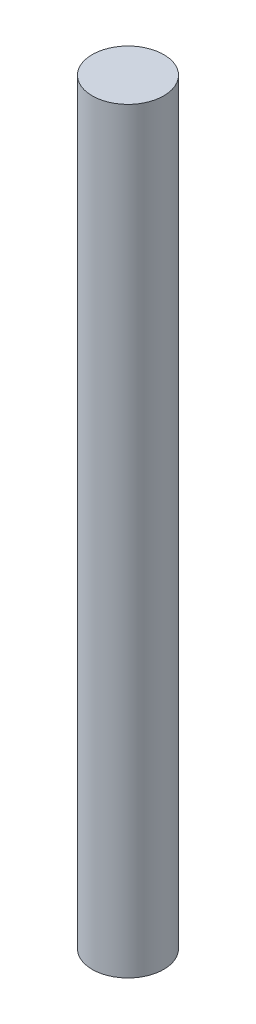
from build123d import *

# Parameters (mm, degrees)
ESQUISSE1_R        = 3.45
BOSS_EXTRU_1_DEPTH = 73


with BuildPart() as part:
    # Esquisse1 → Boss.-Extru.1 (new body)
    with BuildSketch(Plane(origin=(0, 0, 0), x_dir=(1, 0, 0), z_dir=(0, 1, 0))):
        with Locations(Location((0, 0, 0), (0, 0, 270))):
            Circle(ESQUISSE1_R)
    extrude(amount=BOSS_EXTRU_1_DEPTH)


solid = part.part
